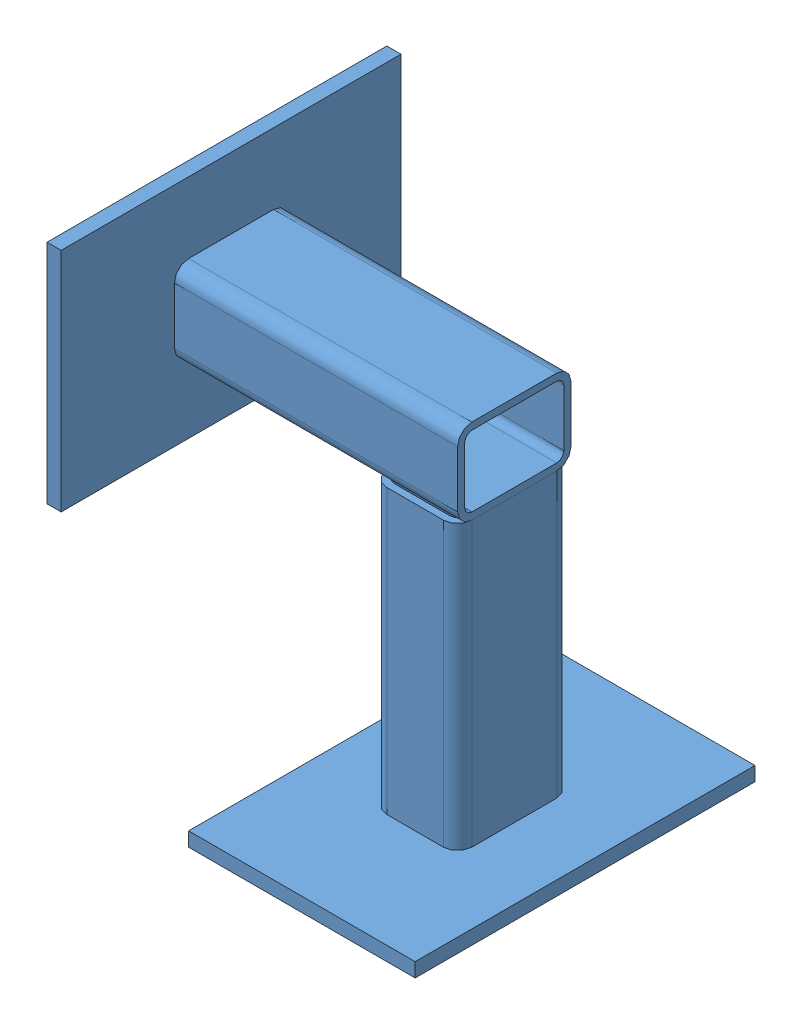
SolidWorks assembly weld bead assembly.SLDASM, configuration Default (file format 5800). Lengths in mm.
Overall size (330.2 406.4 304.8).
2 component instances, 1 part files, 3 mates.
Components (placement in the parent):
- weldment adding plates-1: weldment adding plates.SLDPRT [Default<As Machined>] at origin size (203.2 266.7 304.8)
- weldment adding plates-2: weldment adding plates.SLDPRT [Default<As Machined>] at (-215.9 292.1 0) x (0 1 0) z (0 0 -1) size (203.2 266.7 304.8)
Mates (geometry in assembly coordinates):
- Coincident1: coincident: plane of weldment adding plates-1 through (-25.4 254 38.1) normal (0 1 0); plane of weldment adding plates-2 through (38.1 254 -38.1) normal (0 -1 0)
- Coincident2: coincident: plane of weldment adding plates-1 through (38.1 254 -38.1) normal (1 0 0); plane of weldment adding plates-2 through (38.1 266.7 -38.1) normal (1 0 0)
- Coincident3: coincident aligned: plane of weldment adding plates-1 through (-25.4 254 50.8) normal (0 0 1); plane of weldment adding plates-2 through (38.1 317.5 50.8) normal (0 0 1)
